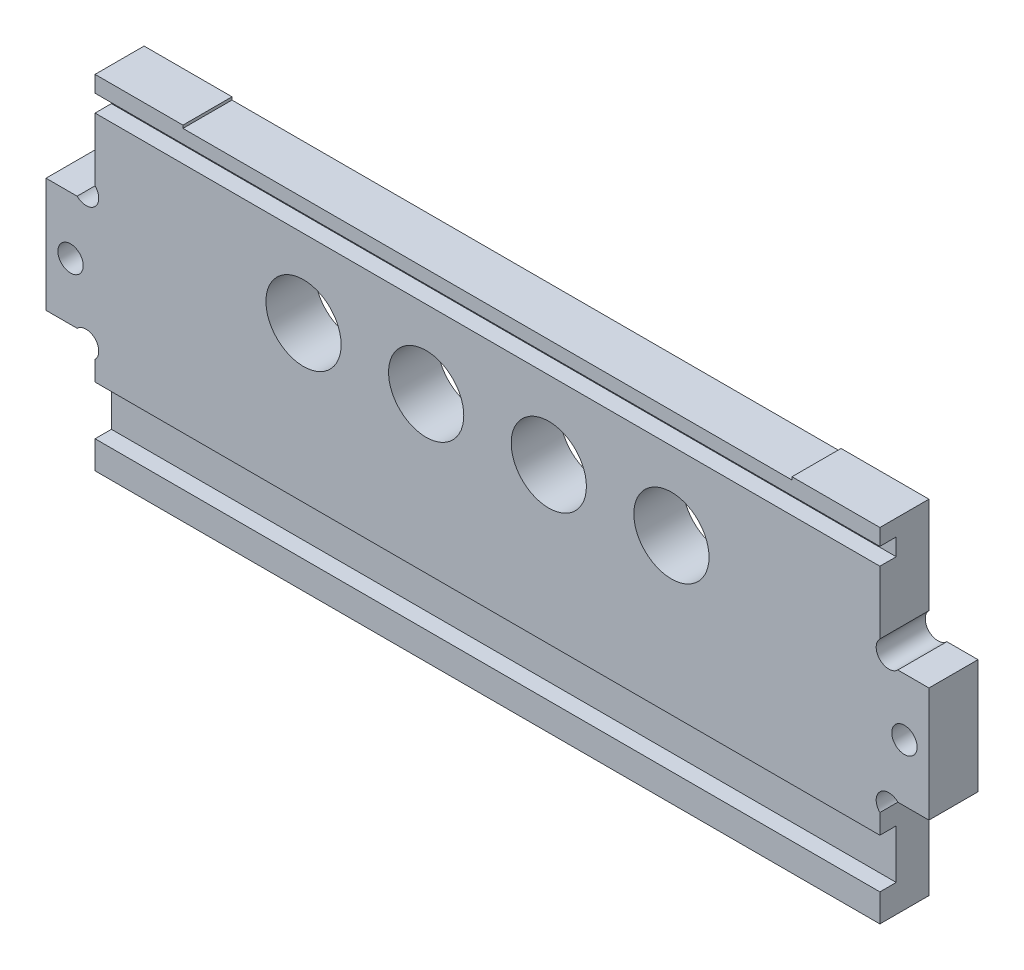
ISO-10303-21;
HEADER;
FILE_DESCRIPTION(('STEP AP214'),'2;1');
FILE_NAME('part.step','',(''),(''),'','','');
FILE_SCHEMA(('AUTOMOTIVE_DESIGN { 1 0 10303 214 1 1 1 1 }'));
ENDSEC;
DATA;
#1=APPLICATION_CONTEXT('core data for automotive mechanical design processes');
#2=APPLICATION_PROTOCOL_DEFINITION('international standard','automotive_design',2000,#1);
#3=PRODUCT_CONTEXT('',#1,'mechanical');
#4=PRODUCT('Part','Part','',(#3));
#5=PRODUCT_RELATED_PRODUCT_CATEGORY('part','',(#4));
#6=PRODUCT_DEFINITION_FORMATION('','',#4);
#7=PRODUCT_DEFINITION_CONTEXT('part definition',#1,'design');
#8=PRODUCT_DEFINITION('design','',#6,#7);
#9=PRODUCT_DEFINITION_SHAPE('','',#8);
#10=(LENGTH_UNIT() NAMED_UNIT(*) SI_UNIT(.MILLI.,.METRE.));
#11=(NAMED_UNIT(*) PLANE_ANGLE_UNIT() SI_UNIT($,.RADIAN.));
#12=(NAMED_UNIT(*) SI_UNIT($,.STERADIAN.) SOLID_ANGLE_UNIT());
#13=UNCERTAINTY_MEASURE_WITH_UNIT(LENGTH_MEASURE(1.E-05),#10,'distance_accuracy_value','');
#14=(GEOMETRIC_REPRESENTATION_CONTEXT(3) GLOBAL_UNCERTAINTY_ASSIGNED_CONTEXT((#13)) GLOBAL_UNIT_ASSIGNED_CONTEXT((#10,
#11,#12)) REPRESENTATION_CONTEXT('',''));
#15=CARTESIAN_POINT('',(0.,0.,0.));
#16=DIRECTION('',(0.,0.,1.));
#17=DIRECTION('',(1.,0.,0.));
#18=AXIS2_PLACEMENT_3D('',#15,#16,#17);
#19=CARTESIAN_POINT('',(4.90398448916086,29.0960155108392,6.));
#20=DIRECTION('',(0.,0.,1.));
#21=DIRECTION('',(1.,0.,0.));
#22=AXIS2_PLACEMENT_3D('',#19,#20,#21);
#23=PLANE('',#22);
#24=DIRECTION('',(-1.,0.,0.));
#25=VECTOR('',#24,1.);
#26=CARTESIAN_POINT('',(3.,9.40000000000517,6.));
#27=LINE('',#26,#25);
#28=CARTESIAN_POINT('',(102.,9.40000000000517,6.));
#29=VERTEX_POINT('',#28);
#30=CARTESIAN_POINT('',(6.,9.40000000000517,6.));
#31=VERTEX_POINT('',#30);
#32=EDGE_CURVE('E232',#29,#31,#27,.T.);
#33=ORIENTED_EDGE('',*,*,#32,.F.);
#34=DIRECTION('',(0.,1.,0.));
#35=VECTOR('',#34,1.);
#36=CARTESIAN_POINT('',(102.,11.8079689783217,6.));
#37=LINE('',#36,#35);
#38=CARTESIAN_POINT('',(102.,11.8079689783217,6.));
#39=VERTEX_POINT('',#38);
#40=EDGE_CURVE('E248',#29,#39,#37,.T.);
#41=ORIENTED_EDGE('',*,*,#40,.T.);
#42=CARTESIAN_POINT('',(103.096015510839,12.9039844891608,6.));
#43=DIRECTION('',(0.,0.,-1.));
#44=DIRECTION('',(1.,0.,0.));
#45=AXIS2_PLACEMENT_3D('',#42,#43,#44);
#46=CIRCLE('',#45,1.55);
#47=CARTESIAN_POINT('',(104.192031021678,14.,6.));
#48=VERTEX_POINT('',#47);
#49=EDGE_CURVE('E250',#39,#48,#46,.T.);
#50=ORIENTED_EDGE('',*,*,#49,.T.);
#51=DIRECTION('',(1.,0.,0.));
#52=VECTOR('',#51,1.);
#53=CARTESIAN_POINT('',(108.,14.,6.));
#54=LINE('',#53,#52);
#55=CARTESIAN_POINT('',(108.,14.,6.));
#56=VERTEX_POINT('',#55);
#57=EDGE_CURVE('E252',#48,#56,#54,.T.);
#58=ORIENTED_EDGE('',*,*,#57,.T.);
#59=DIRECTION('',(0.,1.,0.));
#60=VECTOR('',#59,1.);
#61=CARTESIAN_POINT('',(108.,28.,6.));
#62=LINE('',#61,#60);
#63=CARTESIAN_POINT('',(108.,28.,6.));
#64=VERTEX_POINT('',#63);
#65=EDGE_CURVE('E254',#56,#64,#62,.T.);
#66=ORIENTED_EDGE('',*,*,#65,.T.);
#67=DIRECTION('',(-1.,0.,0.));
#68=VECTOR('',#67,1.);
#69=CARTESIAN_POINT('',(104.192031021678,28.,6.));
#70=LINE('',#69,#68);
#71=CARTESIAN_POINT('',(104.192031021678,28.,6.));
#72=VERTEX_POINT('',#71);
#73=EDGE_CURVE('E256',#64,#72,#70,.T.);
#74=ORIENTED_EDGE('',*,*,#73,.T.);
#75=CARTESIAN_POINT('',(103.096015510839,29.0960155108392,6.));
#76=DIRECTION('',(0.,0.,-1.));
#77=DIRECTION('',(-1.,0.,0.));
#78=AXIS2_PLACEMENT_3D('',#75,#76,#77);
#79=CIRCLE('',#78,1.55);
#80=CARTESIAN_POINT('',(102.,30.1920310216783,6.));
#81=VERTEX_POINT('',#80);
#82=EDGE_CURVE('E258',#72,#81,#79,.T.);
#83=ORIENTED_EDGE('',*,*,#82,.T.);
#84=DIRECTION('',(0.,1.,0.));
#85=VECTOR('',#84,1.);
#86=CARTESIAN_POINT('',(102.,42.,6.));
#87=LINE('',#86,#85);
#88=CARTESIAN_POINT('',(102.,37.89999053,6.));
#89=VERTEX_POINT('',#88);
#90=EDGE_CURVE('E261',#81,#89,#87,.T.);
#91=ORIENTED_EDGE('',*,*,#90,.T.);
#92=DIRECTION('',(1.,0.,0.));
#93=VECTOR('',#92,1.);
#94=CARTESIAN_POINT('',(3.,37.89999053,6.));
#95=LINE('',#94,#93);
#96=CARTESIAN_POINT('',(6.00000000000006,37.89999053,6.));
#97=VERTEX_POINT('',#96);
#98=EDGE_CURVE('E359',#97,#89,#95,.T.);
#99=ORIENTED_EDGE('',*,*,#98,.F.);
#100=DIRECTION('',(0.,-1.,0.));
#101=VECTOR('',#100,1.);
#102=CARTESIAN_POINT('',(6.00000000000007,42.,6.));
#103=LINE('',#102,#101);
#104=CARTESIAN_POINT('',(6.,30.1920310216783,6.));
#105=VERTEX_POINT('',#104);
#106=EDGE_CURVE('E452',#97,#105,#103,.T.);
#107=ORIENTED_EDGE('',*,*,#106,.T.);
#108=CARTESIAN_POINT('',(4.90398448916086,29.0960155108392,6.));
#109=DIRECTION('',(0.,0.,-1.));
#110=DIRECTION('',(1.,0.,0.));
#111=AXIS2_PLACEMENT_3D('',#108,#109,#110);
#112=CIRCLE('',#111,1.55);
#113=CARTESIAN_POINT('',(3.80796897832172,28.,6.));
#114=VERTEX_POINT('',#113);
#115=EDGE_CURVE('E456',#105,#114,#112,.T.);
#116=ORIENTED_EDGE('',*,*,#115,.T.);
#117=DIRECTION('',(-1.,0.,0.));
#118=VECTOR('',#117,1.);
#119=CARTESIAN_POINT('',(3.80796897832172,28.,6.));
#120=LINE('',#119,#118);
#121=CARTESIAN_POINT('',(0.,28.,6.));
#122=VERTEX_POINT('',#121);
#123=EDGE_CURVE('E458',#114,#122,#120,.T.);
#124=ORIENTED_EDGE('',*,*,#123,.T.);
#125=DIRECTION('',(0.,-1.,0.));
#126=VECTOR('',#125,1.);
#127=CARTESIAN_POINT('',(0.,28.,6.));
#128=LINE('',#127,#126);
#129=CARTESIAN_POINT('',(0.,14.,6.));
#130=VERTEX_POINT('',#129);
#131=EDGE_CURVE('E460',#122,#130,#128,.T.);
#132=ORIENTED_EDGE('',*,*,#131,.T.);
#133=DIRECTION('',(1.,0.,0.));
#134=VECTOR('',#133,1.);
#135=CARTESIAN_POINT('',(0.,14.,6.));
#136=LINE('',#135,#134);
#137=CARTESIAN_POINT('',(3.80796897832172,14.,6.));
#138=VERTEX_POINT('',#137);
#139=EDGE_CURVE('E243',#130,#138,#136,.T.);
#140=ORIENTED_EDGE('',*,*,#139,.T.);
#141=CARTESIAN_POINT('',(4.90398448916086,12.9039844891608,6.));
#142=DIRECTION('',(0.,0.,-1.));
#143=DIRECTION('',(-1.,0.,0.));
#144=AXIS2_PLACEMENT_3D('',#141,#142,#143);
#145=CIRCLE('',#144,1.55);
#146=CARTESIAN_POINT('',(6.,11.8079689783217,6.));
#147=VERTEX_POINT('',#146);
#148=EDGE_CURVE('E239',#138,#147,#145,.T.);
#149=ORIENTED_EDGE('',*,*,#148,.T.);
#150=DIRECTION('',(0.,-1.,0.));
#151=VECTOR('',#150,1.);
#152=CARTESIAN_POINT('',(6.,11.8079689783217,6.));
#153=LINE('',#152,#151);
#154=EDGE_CURVE('E238',#147,#31,#153,.T.);
#155=ORIENTED_EDGE('',*,*,#154,.T.);
#156=EDGE_LOOP('',(#33,#41,#50,#58,#66,#74,#83,#91,#99,#107,#116,#124,#132,#140,#149,#155));
#157=FACE_BOUND('',#156,.T.);
#158=CARTESIAN_POINT('',(76.5,28.4,6.));
#159=DIRECTION('',(0.,0.,1.));
#160=DIRECTION('',(1.,0.,0.));
#161=AXIS2_PLACEMENT_3D('',#158,#159,#160);
#162=CIRCLE('',#161,4.60000000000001);
#163=CARTESIAN_POINT('',(81.1,28.4,6.));
#164=VERTEX_POINT('',#163);
#165=EDGE_CURVE('E378',#164,#164,#162,.T.);
#166=ORIENTED_EDGE('',*,*,#165,.F.);
#167=EDGE_LOOP('',(#166));
#168=FACE_BOUND('',#167,.T.);
#169=CARTESIAN_POINT('',(46.5,28.4,6.));
#170=DIRECTION('',(0.,0.,1.));
#171=DIRECTION('',(1.,0.,0.));
#172=AXIS2_PLACEMENT_3D('',#169,#170,#171);
#173=CIRCLE('',#172,4.6);
#174=CARTESIAN_POINT('',(51.1,28.4,6.));
#175=VERTEX_POINT('',#174);
#176=EDGE_CURVE('E390',#175,#175,#173,.T.);
#177=ORIENTED_EDGE('',*,*,#176,.F.);
#178=EDGE_LOOP('',(#177));
#179=FACE_BOUND('',#178,.T.);
#180=CARTESIAN_POINT('',(3.,21.,6.));
#181=DIRECTION('',(0.,0.,1.));
#182=DIRECTION('',(1.,0.,0.));
#183=AXIS2_PLACEMENT_3D('',#180,#181,#182);
#184=CIRCLE('',#183,1.55);
#185=CARTESIAN_POINT('',(4.55,21.,6.));
#186=VERTEX_POINT('',#185);
#187=EDGE_CURVE('E402',#186,#186,#184,.T.);
#188=ORIENTED_EDGE('',*,*,#187,.F.);
#189=EDGE_LOOP('',(#188));
#190=FACE_BOUND('',#189,.T.);
#191=CARTESIAN_POINT('',(31.5,28.4,6.));
#192=DIRECTION('',(0.,0.,1.));
#193=DIRECTION('',(1.,0.,0.));
#194=AXIS2_PLACEMENT_3D('',#191,#192,#193);
#195=CIRCLE('',#194,4.6);
#196=CARTESIAN_POINT('',(36.1,28.4,6.));
#197=VERTEX_POINT('',#196);
#198=EDGE_CURVE('E408',#197,#197,#195,.T.);
#199=ORIENTED_EDGE('',*,*,#198,.F.);
#200=EDGE_LOOP('',(#199));
#201=FACE_BOUND('',#200,.T.);
#202=CARTESIAN_POINT('',(105.,21.,6.));
#203=DIRECTION('',(0.,0.,1.));
#204=DIRECTION('',(-1.,0.,0.));
#205=AXIS2_PLACEMENT_3D('',#202,#203,#204);
#206=CIRCLE('',#205,1.55000000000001);
#207=CARTESIAN_POINT('',(103.45,21.,6.));
#208=VERTEX_POINT('',#207);
#209=EDGE_CURVE('E396',#208,#208,#206,.T.);
#210=ORIENTED_EDGE('',*,*,#209,.F.);
#211=EDGE_LOOP('',(#210));
#212=FACE_BOUND('',#211,.T.);
#213=CARTESIAN_POINT('',(61.5,28.4,6.));
#214=DIRECTION('',(0.,0.,1.));
#215=DIRECTION('',(1.,0.,0.));
#216=AXIS2_PLACEMENT_3D('',#213,#214,#215);
#217=CIRCLE('',#216,4.60000000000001);
#218=CARTESIAN_POINT('',(66.1,28.4,6.));
#219=VERTEX_POINT('',#218);
#220=EDGE_CURVE('E384',#219,#219,#217,.T.);
#221=ORIENTED_EDGE('',*,*,#220,.F.);
#222=EDGE_LOOP('',(#221));
#223=FACE_BOUND('',#222,.T.);
#224=ADVANCED_FACE('F30',(#157,#168,#179,#190,#201,#212,#223),#23,.T.);
#225=DIRECTION('',(-1.,0.,0.));
#226=VECTOR('',#225,1.);
#227=CARTESIAN_POINT('',(3.,40.,6.));
#228=LINE('',#227,#226);
#229=CARTESIAN_POINT('',(102.,40.,6.));
#230=VERTEX_POINT('',#229);
#231=CARTESIAN_POINT('',(6.00000000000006,40.,6.));
#232=VERTEX_POINT('',#231);
#233=EDGE_CURVE('E361',#230,#232,#228,.T.);
#234=ORIENTED_EDGE('',*,*,#233,.F.);
#235=CARTESIAN_POINT('',(102.,42.,6.));
#236=VERTEX_POINT('',#235);
#237=EDGE_CURVE('E260',#230,#236,#87,.T.);
#238=ORIENTED_EDGE('',*,*,#237,.T.);
#239=DIRECTION('',(-1.,0.,0.));
#240=VECTOR('',#239,1.);
#241=CARTESIAN_POINT('',(91.25,42.,6.));
#242=LINE('',#241,#240);
#243=CARTESIAN_POINT('',(91.25,42.,6.));
#244=VERTEX_POINT('',#243);
#245=EDGE_CURVE('E264',#236,#244,#242,.T.);
#246=ORIENTED_EDGE('',*,*,#245,.T.);
#247=DIRECTION('',(0.,-1.,0.));
#248=VECTOR('',#247,1.);
#249=CARTESIAN_POINT('',(91.25,41.65,6.));
#250=LINE('',#249,#248);
#251=CARTESIAN_POINT('',(91.25,41.65,6.));
#252=VERTEX_POINT('',#251);
#253=EDGE_CURVE('E266',#244,#252,#250,.T.);
#254=ORIENTED_EDGE('',*,*,#253,.T.);
#255=DIRECTION('',(-1.,0.,0.));
#256=VECTOR('',#255,1.);
#257=CARTESIAN_POINT('',(91.25,41.65,6.));
#258=LINE('',#257,#256);
#259=CARTESIAN_POINT('',(16.75,41.65,6.));
#260=VERTEX_POINT('',#259);
#261=EDGE_CURVE('E268',#252,#260,#258,.T.);
#262=ORIENTED_EDGE('',*,*,#261,.T.);
#263=DIRECTION('',(0.,1.,0.));
#264=VECTOR('',#263,1.);
#265=CARTESIAN_POINT('',(16.75,42.,6.));
#266=LINE('',#265,#264);
#267=CARTESIAN_POINT('',(16.75,42.,6.));
#268=VERTEX_POINT('',#267);
#269=EDGE_CURVE('E270',#260,#268,#266,.T.);
#270=ORIENTED_EDGE('',*,*,#269,.T.);
#271=DIRECTION('',(-1.,0.,0.));
#272=VECTOR('',#271,1.);
#273=CARTESIAN_POINT('',(6.00000000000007,42.,6.));
#274=LINE('',#273,#272);
#275=CARTESIAN_POINT('',(6.00000000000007,42.,6.));
#276=VERTEX_POINT('',#275);
#277=EDGE_CURVE('E272',#268,#276,#274,.T.);
#278=ORIENTED_EDGE('',*,*,#277,.T.);
#279=EDGE_CURVE('E453',#276,#232,#103,.T.);
#280=ORIENTED_EDGE('',*,*,#279,.T.);
#281=EDGE_LOOP('',(#234,#238,#246,#254,#262,#270,#278,#280));
#282=FACE_BOUND('',#281,.T.);
#283=ADVANCED_FACE('F547',(#282),#23,.T.);
#284=DIRECTION('',(1.,0.,0.));
#285=VECTOR('',#284,1.);
#286=CARTESIAN_POINT('',(3.,3.40000000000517,6.));
#287=LINE('',#286,#285);
#288=CARTESIAN_POINT('',(6.,3.40000000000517,6.));
#289=VERTEX_POINT('',#288);
#290=CARTESIAN_POINT('',(102.,3.40000000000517,6.));
#291=VERTEX_POINT('',#290);
#292=EDGE_CURVE('E217',#289,#291,#287,.T.);
#293=ORIENTED_EDGE('',*,*,#292,.F.);
#294=CARTESIAN_POINT('',(6.,0.,6.));
#295=VERTEX_POINT('',#294);
#296=EDGE_CURVE('E228',#289,#295,#153,.T.);
#297=ORIENTED_EDGE('',*,*,#296,.T.);
#298=DIRECTION('',(1.,0.,0.));
#299=VECTOR('',#298,1.);
#300=CARTESIAN_POINT('',(6.,0.,6.));
#301=LINE('',#300,#299);
#302=CARTESIAN_POINT('',(102.,0.,6.));
#303=VERTEX_POINT('',#302);
#304=EDGE_CURVE('E242',#295,#303,#301,.T.);
#305=ORIENTED_EDGE('',*,*,#304,.T.);
#306=EDGE_CURVE('E231',#303,#291,#37,.T.);
#307=ORIENTED_EDGE('',*,*,#306,.T.);
#308=EDGE_LOOP('',(#293,#297,#305,#307));
#309=FACE_BOUND('',#308,.T.);
#310=ADVANCED_FACE('F227',(#309),#23,.T.);
#311=CARTESIAN_POINT('',(4.90398448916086,29.0960155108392,0.));
#312=DIRECTION('',(0.,0.,1.));
#313=DIRECTION('',(1.,0.,0.));
#314=AXIS2_PLACEMENT_3D('',#311,#312,#313);
#315=PLANE('',#314);
#316=CARTESIAN_POINT('',(61.5,28.4,0.));
#317=DIRECTION('',(0.,0.,1.));
#318=DIRECTION('',(1.,0.,0.));
#319=AXIS2_PLACEMENT_3D('',#316,#317,#318);
#320=CIRCLE('',#319,4.60000000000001);
#321=CARTESIAN_POINT('',(66.1,28.4,0.));
#322=VERTEX_POINT('',#321);
#323=EDGE_CURVE('E381',#322,#322,#320,.T.);
#324=ORIENTED_EDGE('',*,*,#323,.T.);
#325=EDGE_LOOP('',(#324));
#326=FACE_BOUND('',#325,.T.);
#327=CARTESIAN_POINT('',(105.,21.,0.));
#328=DIRECTION('',(0.,0.,1.));
#329=DIRECTION('',(-1.,0.,0.));
#330=AXIS2_PLACEMENT_3D('',#327,#328,#329);
#331=CIRCLE('',#330,1.55000000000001);
#332=CARTESIAN_POINT('',(103.45,21.,0.));
#333=VERTEX_POINT('',#332);
#334=EDGE_CURVE('E393',#333,#333,#331,.T.);
#335=ORIENTED_EDGE('',*,*,#334,.T.);
#336=EDGE_LOOP('',(#335));
#337=FACE_BOUND('',#336,.T.);
#338=CARTESIAN_POINT('',(31.5,28.4,0.));
#339=DIRECTION('',(0.,0.,1.));
#340=DIRECTION('',(1.,0.,0.));
#341=AXIS2_PLACEMENT_3D('',#338,#339,#340);
#342=CIRCLE('',#341,4.6);
#343=CARTESIAN_POINT('',(36.1,28.4,0.));
#344=VERTEX_POINT('',#343);
#345=EDGE_CURVE('E405',#344,#344,#342,.T.);
#346=ORIENTED_EDGE('',*,*,#345,.T.);
#347=EDGE_LOOP('',(#346));
#348=FACE_BOUND('',#347,.T.);
#349=DIRECTION('',(0.,-1.,0.));
#350=VECTOR('',#349,1.);
#351=CARTESIAN_POINT('',(6.00000000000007,42.,0.));
#352=LINE('',#351,#350);
#353=CARTESIAN_POINT('',(6.00000000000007,42.,0.));
#354=VERTEX_POINT('',#353);
#355=CARTESIAN_POINT('',(6.,30.1920310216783,0.));
#356=VERTEX_POINT('',#355);
#357=EDGE_CURVE('E411',#354,#356,#352,.T.);
#358=ORIENTED_EDGE('',*,*,#357,.F.);
#359=DIRECTION('',(-1.,0.,0.));
#360=VECTOR('',#359,1.);
#361=CARTESIAN_POINT('',(6.00000000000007,42.,0.));
#362=LINE('',#361,#360);
#363=CARTESIAN_POINT('',(16.75,42.,0.));
#364=VERTEX_POINT('',#363);
#365=EDGE_CURVE('E450',#364,#354,#362,.T.);
#366=ORIENTED_EDGE('',*,*,#365,.F.);
#367=DIRECTION('',(0.,1.,0.));
#368=VECTOR('',#367,1.);
#369=CARTESIAN_POINT('',(16.75,42.,0.));
#370=LINE('',#369,#368);
#371=CARTESIAN_POINT('',(16.75,41.65,0.));
#372=VERTEX_POINT('',#371);
#373=EDGE_CURVE('E448',#372,#364,#370,.T.);
#374=ORIENTED_EDGE('',*,*,#373,.F.);
#375=DIRECTION('',(-1.,0.,0.));
#376=VECTOR('',#375,1.);
#377=CARTESIAN_POINT('',(91.25,41.65,0.));
#378=LINE('',#377,#376);
#379=CARTESIAN_POINT('',(91.25,41.65,0.));
#380=VERTEX_POINT('',#379);
#381=EDGE_CURVE('E446',#380,#372,#378,.T.);
#382=ORIENTED_EDGE('',*,*,#381,.F.);
#383=DIRECTION('',(0.,-1.,0.));
#384=VECTOR('',#383,1.);
#385=CARTESIAN_POINT('',(91.25,41.65,0.));
#386=LINE('',#385,#384);
#387=CARTESIAN_POINT('',(91.25,42.,0.));
#388=VERTEX_POINT('',#387);
#389=EDGE_CURVE('E444',#388,#380,#386,.T.);
#390=ORIENTED_EDGE('',*,*,#389,.F.);
#391=DIRECTION('',(-1.,0.,0.));
#392=VECTOR('',#391,1.);
#393=CARTESIAN_POINT('',(91.25,42.,0.));
#394=LINE('',#393,#392);
#395=CARTESIAN_POINT('',(102.,42.,0.));
#396=VERTEX_POINT('',#395);
#397=EDGE_CURVE('E442',#396,#388,#394,.T.);
#398=ORIENTED_EDGE('',*,*,#397,.F.);
#399=DIRECTION('',(0.,1.,0.));
#400=VECTOR('',#399,1.);
#401=CARTESIAN_POINT('',(102.,42.,0.));
#402=LINE('',#401,#400);
#403=CARTESIAN_POINT('',(102.,30.1920310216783,0.));
#404=VERTEX_POINT('',#403);
#405=EDGE_CURVE('E440',#404,#396,#402,.T.);
#406=ORIENTED_EDGE('',*,*,#405,.F.);
#407=CARTESIAN_POINT('',(103.096015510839,29.0960155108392,0.));
#408=DIRECTION('',(0.,0.,-1.));
#409=DIRECTION('',(-1.,0.,0.));
#410=AXIS2_PLACEMENT_3D('',#407,#408,#409);
#411=CIRCLE('',#410,1.55);
#412=CARTESIAN_POINT('',(104.192031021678,28.,0.));
#413=VERTEX_POINT('',#412);
#414=EDGE_CURVE('E438',#413,#404,#411,.T.);
#415=ORIENTED_EDGE('',*,*,#414,.F.);
#416=DIRECTION('',(-1.,0.,0.));
#417=VECTOR('',#416,1.);
#418=CARTESIAN_POINT('',(104.192031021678,28.,0.));
#419=LINE('',#418,#417);
#420=CARTESIAN_POINT('',(108.,28.,0.));
#421=VERTEX_POINT('',#420);
#422=EDGE_CURVE('E436',#421,#413,#419,.T.);
#423=ORIENTED_EDGE('',*,*,#422,.F.);
#424=DIRECTION('',(0.,1.,0.));
#425=VECTOR('',#424,1.);
#426=CARTESIAN_POINT('',(108.,28.,0.));
#427=LINE('',#426,#425);
#428=CARTESIAN_POINT('',(108.,14.,0.));
#429=VERTEX_POINT('',#428);
#430=EDGE_CURVE('E434',#429,#421,#427,.T.);
#431=ORIENTED_EDGE('',*,*,#430,.F.);
#432=DIRECTION('',(1.,0.,0.));
#433=VECTOR('',#432,1.);
#434=CARTESIAN_POINT('',(108.,14.,0.));
#435=LINE('',#434,#433);
#436=CARTESIAN_POINT('',(104.192031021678,14.,0.));
#437=VERTEX_POINT('',#436);
#438=EDGE_CURVE('E432',#437,#429,#435,.T.);
#439=ORIENTED_EDGE('',*,*,#438,.F.);
#440=CARTESIAN_POINT('',(103.096015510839,12.9039844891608,0.));
#441=DIRECTION('',(0.,0.,-1.));
#442=DIRECTION('',(1.,0.,0.));
#443=AXIS2_PLACEMENT_3D('',#440,#441,#442);
#444=CIRCLE('',#443,1.55);
#445=CARTESIAN_POINT('',(102.,11.8079689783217,0.));
#446=VERTEX_POINT('',#445);
#447=EDGE_CURVE('E430',#446,#437,#444,.T.);
#448=ORIENTED_EDGE('',*,*,#447,.F.);
#449=DIRECTION('',(0.,1.,0.));
#450=VECTOR('',#449,1.);
#451=CARTESIAN_POINT('',(102.,11.8079689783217,0.));
#452=LINE('',#451,#450);
#453=CARTESIAN_POINT('',(102.,0.,0.));
#454=VERTEX_POINT('',#453);
#455=EDGE_CURVE('E428',#454,#446,#452,.T.);
#456=ORIENTED_EDGE('',*,*,#455,.F.);
#457=DIRECTION('',(1.,0.,0.));
#458=VECTOR('',#457,1.);
#459=CARTESIAN_POINT('',(6.,0.,0.));
#460=LINE('',#459,#458);
#461=CARTESIAN_POINT('',(6.,0.,0.));
#462=VERTEX_POINT('',#461);
#463=EDGE_CURVE('E426',#462,#454,#460,.T.);
#464=ORIENTED_EDGE('',*,*,#463,.F.);
#465=DIRECTION('',(0.,-1.,0.));
#466=VECTOR('',#465,1.);
#467=CARTESIAN_POINT('',(6.,11.8079689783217,0.));
#468=LINE('',#467,#466);
#469=CARTESIAN_POINT('',(6.,11.8079689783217,0.));
#470=VERTEX_POINT('',#469);
#471=EDGE_CURVE('E424',#470,#462,#468,.T.);
#472=ORIENTED_EDGE('',*,*,#471,.F.);
#473=CARTESIAN_POINT('',(4.90398448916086,12.9039844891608,0.));
#474=DIRECTION('',(0.,0.,-1.));
#475=DIRECTION('',(-1.,0.,0.));
#476=AXIS2_PLACEMENT_3D('',#473,#474,#475);
#477=CIRCLE('',#476,1.55);
#478=CARTESIAN_POINT('',(3.80796897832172,14.,0.));
#479=VERTEX_POINT('',#478);
#480=EDGE_CURVE('E422',#479,#470,#477,.T.);
#481=ORIENTED_EDGE('',*,*,#480,.F.);
#482=DIRECTION('',(1.,0.,0.));
#483=VECTOR('',#482,1.);
#484=CARTESIAN_POINT('',(0.,14.,0.));
#485=LINE('',#484,#483);
#486=CARTESIAN_POINT('',(0.,14.,0.));
#487=VERTEX_POINT('',#486);
#488=EDGE_CURVE('E420',#487,#479,#485,.T.);
#489=ORIENTED_EDGE('',*,*,#488,.F.);
#490=DIRECTION('',(0.,-1.,0.));
#491=VECTOR('',#490,1.);
#492=CARTESIAN_POINT('',(0.,28.,0.));
#493=LINE('',#492,#491);
#494=CARTESIAN_POINT('',(0.,28.,0.));
#495=VERTEX_POINT('',#494);
#496=EDGE_CURVE('E418',#495,#487,#493,.T.);
#497=ORIENTED_EDGE('',*,*,#496,.F.);
#498=DIRECTION('',(-1.,0.,0.));
#499=VECTOR('',#498,1.);
#500=CARTESIAN_POINT('',(3.80796897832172,28.,0.));
#501=LINE('',#500,#499);
#502=CARTESIAN_POINT('',(3.80796897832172,28.,0.));
#503=VERTEX_POINT('',#502);
#504=EDGE_CURVE('E416',#503,#495,#501,.T.);
#505=ORIENTED_EDGE('',*,*,#504,.F.);
#506=CARTESIAN_POINT('',(4.90398448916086,29.0960155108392,0.));
#507=DIRECTION('',(0.,0.,-1.));
#508=DIRECTION('',(1.,0.,0.));
#509=AXIS2_PLACEMENT_3D('',#506,#507,#508);
#510=CIRCLE('',#509,1.55);
#511=EDGE_CURVE('E414',#356,#503,#510,.T.);
#512=ORIENTED_EDGE('',*,*,#511,.F.);
#513=EDGE_LOOP('',(#358,#366,#374,#382,#390,#398,#406,#415,#423,#431,#439,#448,#456,#464,#472,
#481,#489,#497,#505,#512));
#514=FACE_BOUND('',#513,.T.);
#515=CARTESIAN_POINT('',(3.,21.,0.));
#516=DIRECTION('',(0.,0.,1.));
#517=DIRECTION('',(1.,0.,0.));
#518=AXIS2_PLACEMENT_3D('',#515,#516,#517);
#519=CIRCLE('',#518,1.55);
#520=CARTESIAN_POINT('',(4.55,21.,0.));
#521=VERTEX_POINT('',#520);
#522=EDGE_CURVE('E399',#521,#521,#519,.T.);
#523=ORIENTED_EDGE('',*,*,#522,.T.);
#524=EDGE_LOOP('',(#523));
#525=FACE_BOUND('',#524,.T.);
#526=CARTESIAN_POINT('',(46.5,28.4,0.));
#527=DIRECTION('',(0.,0.,1.));
#528=DIRECTION('',(1.,0.,0.));
#529=AXIS2_PLACEMENT_3D('',#526,#527,#528);
#530=CIRCLE('',#529,4.6);
#531=CARTESIAN_POINT('',(51.1,28.4,0.));
#532=VERTEX_POINT('',#531);
#533=EDGE_CURVE('E387',#532,#532,#530,.T.);
#534=ORIENTED_EDGE('',*,*,#533,.T.);
#535=EDGE_LOOP('',(#534));
#536=FACE_BOUND('',#535,.T.);
#537=CARTESIAN_POINT('',(76.5,28.4,0.));
#538=DIRECTION('',(0.,0.,1.));
#539=DIRECTION('',(1.,0.,0.));
#540=AXIS2_PLACEMENT_3D('',#537,#538,#539);
#541=CIRCLE('',#540,4.60000000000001);
#542=CARTESIAN_POINT('',(81.1,28.4,0.));
#543=VERTEX_POINT('',#542);
#544=EDGE_CURVE('E375',#543,#543,#541,.T.);
#545=ORIENTED_EDGE('',*,*,#544,.T.);
#546=EDGE_LOOP('',(#545));
#547=FACE_BOUND('',#546,.T.);
#548=ADVANCED_FACE('F531',(#326,#337,#348,#514,#525,#536,#547),#315,.F.);
#549=CARTESIAN_POINT('',(6.00000000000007,42.,6.));
#550=DIRECTION('',(1.,0.,0.));
#551=DIRECTION('',(0.,1.,0.));
#552=AXIS2_PLACEMENT_3D('',#549,#550,#551);
#553=PLANE('',#552);
#554=DIRECTION('',(0.,-1.,0.));
#555=VECTOR('',#554,1.);
#556=CARTESIAN_POINT('',(6.00000000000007,42.,4.));
#557=LINE('',#556,#555);
#558=CARTESIAN_POINT('',(6.00000000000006,40.,4.));
#559=VERTEX_POINT('',#558);
#560=CARTESIAN_POINT('',(6.00000000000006,37.89999053,4.));
#561=VERTEX_POINT('',#560);
#562=EDGE_CURVE('E367',#559,#561,#557,.T.);
#563=ORIENTED_EDGE('',*,*,#562,.F.);
#564=DIRECTION('',(0.,0.,1.));
#565=VECTOR('',#564,1.);
#566=CARTESIAN_POINT('',(6.00000000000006,40.,6.));
#567=LINE('',#566,#565);
#568=EDGE_CURVE('E372',#559,#232,#567,.T.);
#569=ORIENTED_EDGE('',*,*,#568,.T.);
#570=ORIENTED_EDGE('',*,*,#279,.F.);
#571=DIRECTION('',(0.,0.,-1.));
#572=VECTOR('',#571,1.);
#573=CARTESIAN_POINT('',(6.00000000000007,42.,6.));
#574=LINE('',#573,#572);
#575=EDGE_CURVE('E274',#276,#354,#574,.T.);
#576=ORIENTED_EDGE('',*,*,#575,.T.);
#577=ORIENTED_EDGE('',*,*,#357,.T.);
#578=DIRECTION('',(0.,0.,-1.));
#579=VECTOR('',#578,1.);
#580=CARTESIAN_POINT('',(6.,30.1920310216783,6.));
#581=LINE('',#580,#579);
#582=EDGE_CURVE('E329',#105,#356,#581,.T.);
#583=ORIENTED_EDGE('',*,*,#582,.F.);
#584=ORIENTED_EDGE('',*,*,#106,.F.);
#585=DIRECTION('',(0.,0.,-1.));
#586=VECTOR('',#585,1.);
#587=CARTESIAN_POINT('',(6.00000000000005,37.89999053,6.));
#588=LINE('',#587,#586);
#589=EDGE_CURVE('E369',#97,#561,#588,.T.);
#590=ORIENTED_EDGE('',*,*,#589,.T.);
#591=EDGE_LOOP('',(#563,#569,#570,#576,#577,#583,#584,#590));
#592=FACE_BOUND('',#591,.T.);
#593=ADVANCED_FACE('F32',(#592),#553,.F.);
#594=CARTESIAN_POINT('',(4.90398448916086,29.0960155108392,6.));
#595=DIRECTION('',(0.,0.,-1.));
#596=DIRECTION('',(-1.,0.,0.));
#597=AXIS2_PLACEMENT_3D('',#594,#595,#596);
#598=CYLINDRICAL_SURFACE('',#597,1.55);
#599=ORIENTED_EDGE('',*,*,#511,.T.);
#600=DIRECTION('',(0.,0.,-1.));
#601=VECTOR('',#600,1.);
#602=CARTESIAN_POINT('',(3.80796897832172,28.,6.));
#603=LINE('',#602,#601);
#604=EDGE_CURVE('E326',#114,#503,#603,.T.);
#605=ORIENTED_EDGE('',*,*,#604,.F.);
#606=ORIENTED_EDGE('',*,*,#115,.F.);
#607=ORIENTED_EDGE('',*,*,#582,.T.);
#608=EDGE_LOOP('',(#599,#605,#606,#607));
#609=FACE_BOUND('',#608,.T.);
#610=ADVANCED_FACE('F520',(#609),#598,.F.);
#611=CARTESIAN_POINT('',(3.80796897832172,28.,6.));
#612=DIRECTION('',(0.,-1.,0.));
#613=DIRECTION('',(0.,0.,-1.));
#614=AXIS2_PLACEMENT_3D('',#611,#612,#613);
#615=PLANE('',#614);
#616=ORIENTED_EDGE('',*,*,#504,.T.);
#617=DIRECTION('',(0.,0.,-1.));
#618=VECTOR('',#617,1.);
#619=CARTESIAN_POINT('',(0.,28.,6.));
#620=LINE('',#619,#618);
#621=EDGE_CURVE('E323',#122,#495,#620,.T.);
#622=ORIENTED_EDGE('',*,*,#621,.F.);
#623=ORIENTED_EDGE('',*,*,#123,.F.);
#624=ORIENTED_EDGE('',*,*,#604,.T.);
#625=EDGE_LOOP('',(#616,#622,#623,#624));
#626=FACE_BOUND('',#625,.T.);
#627=ADVANCED_FACE('F525',(#626),#615,.F.);
#628=CARTESIAN_POINT('',(0.,28.,6.));
#629=DIRECTION('',(1.,0.,0.));
#630=DIRECTION('',(0.,0.,-1.));
#631=AXIS2_PLACEMENT_3D('',#628,#629,#630);
#632=PLANE('',#631);
#633=ORIENTED_EDGE('',*,*,#496,.T.);
#634=DIRECTION('',(0.,0.,-1.));
#635=VECTOR('',#634,1.);
#636=CARTESIAN_POINT('',(0.,14.,6.));
#637=LINE('',#636,#635);
#638=EDGE_CURVE('E320',#130,#487,#637,.T.);
#639=ORIENTED_EDGE('',*,*,#638,.F.);
#640=ORIENTED_EDGE('',*,*,#131,.F.);
#641=ORIENTED_EDGE('',*,*,#621,.T.);
#642=EDGE_LOOP('',(#633,#639,#640,#641));
#643=FACE_BOUND('',#642,.T.);
#644=ADVANCED_FACE('F529',(#643),#632,.F.);
#645=CARTESIAN_POINT('',(0.,14.,6.));
#646=DIRECTION('',(0.,1.,0.));
#647=DIRECTION('',(0.,0.,1.));
#648=AXIS2_PLACEMENT_3D('',#645,#646,#647);
#649=PLANE('',#648);
#650=ORIENTED_EDGE('',*,*,#488,.T.);
#651=DIRECTION('',(0.,0.,-1.));
#652=VECTOR('',#651,1.);
#653=CARTESIAN_POINT('',(3.80796897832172,14.,6.));
#654=LINE('',#653,#652);
#655=EDGE_CURVE('E317',#138,#479,#654,.T.);
#656=ORIENTED_EDGE('',*,*,#655,.F.);
#657=ORIENTED_EDGE('',*,*,#139,.F.);
#658=ORIENTED_EDGE('',*,*,#638,.T.);
#659=EDGE_LOOP('',(#650,#656,#657,#658));
#660=FACE_BOUND('',#659,.T.);
#661=ADVANCED_FACE('F470',(#660),#649,.F.);
#662=CARTESIAN_POINT('',(4.90398448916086,12.9039844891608,6.));
#663=DIRECTION('',(0.,0.,-1.));
#664=DIRECTION('',(-1.,0.,0.));
#665=AXIS2_PLACEMENT_3D('',#662,#663,#664);
#666=CYLINDRICAL_SURFACE('',#665,1.55);
#667=ORIENTED_EDGE('',*,*,#480,.T.);
#668=DIRECTION('',(0.,0.,-1.));
#669=VECTOR('',#668,1.);
#670=CARTESIAN_POINT('',(6.,11.8079689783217,6.));
#671=LINE('',#670,#669);
#672=EDGE_CURVE('E314',#147,#470,#671,.T.);
#673=ORIENTED_EDGE('',*,*,#672,.F.);
#674=ORIENTED_EDGE('',*,*,#148,.F.);
#675=ORIENTED_EDGE('',*,*,#655,.T.);
#676=EDGE_LOOP('',(#667,#673,#674,#675));
#677=FACE_BOUND('',#676,.T.);
#678=ADVANCED_FACE('F474',(#677),#666,.F.);
#679=CARTESIAN_POINT('',(6.,11.8079689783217,6.));
#680=DIRECTION('',(1.,0.,0.));
#681=DIRECTION('',(0.,1.,0.));
#682=AXIS2_PLACEMENT_3D('',#679,#680,#681);
#683=PLANE('',#682);
#684=DIRECTION('',(0.,-1.,0.));
#685=VECTOR('',#684,1.);
#686=CARTESIAN_POINT('',(6.,11.8079689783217,4.));
#687=LINE('',#686,#685);
#688=CARTESIAN_POINT('',(6.,9.40000000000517,4.));
#689=VERTEX_POINT('',#688);
#690=CARTESIAN_POINT('',(6.,3.40000000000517,4.));
#691=VERTEX_POINT('',#690);
#692=EDGE_CURVE('E223',#689,#691,#687,.T.);
#693=ORIENTED_EDGE('',*,*,#692,.F.);
#694=DIRECTION('',(0.,0.,1.));
#695=VECTOR('',#694,1.);
#696=CARTESIAN_POINT('',(6.,9.40000000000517,6.));
#697=LINE('',#696,#695);
#698=EDGE_CURVE('E222',#689,#31,#697,.T.);
#699=ORIENTED_EDGE('',*,*,#698,.T.);
#700=ORIENTED_EDGE('',*,*,#154,.F.);
#701=ORIENTED_EDGE('',*,*,#672,.T.);
#702=ORIENTED_EDGE('',*,*,#471,.T.);
#703=DIRECTION('',(0.,0.,-1.));
#704=VECTOR('',#703,1.);
#705=CARTESIAN_POINT('',(6.,0.,6.));
#706=LINE('',#705,#704);
#707=EDGE_CURVE('E236',#295,#462,#706,.T.);
#708=ORIENTED_EDGE('',*,*,#707,.F.);
#709=ORIENTED_EDGE('',*,*,#296,.F.);
#710=DIRECTION('',(0.,0.,-1.));
#711=VECTOR('',#710,1.);
#712=CARTESIAN_POINT('',(6.,3.40000000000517,6.));
#713=LINE('',#712,#711);
#714=EDGE_CURVE('E214',#289,#691,#713,.T.);
#715=ORIENTED_EDGE('',*,*,#714,.T.);
#716=EDGE_LOOP('',(#693,#699,#700,#701,#702,#708,#709,#715));
#717=FACE_BOUND('',#716,.T.);
#718=ADVANCED_FACE('F234',(#717),#683,.F.);
#719=CARTESIAN_POINT('',(6.,0.,6.));
#720=DIRECTION('',(0.,1.,0.));
#721=DIRECTION('',(-1.,0.,0.));
#722=AXIS2_PLACEMENT_3D('',#719,#720,#721);
#723=PLANE('',#722);
#724=ORIENTED_EDGE('',*,*,#463,.T.);
#725=DIRECTION('',(0.,0.,-1.));
#726=VECTOR('',#725,1.);
#727=CARTESIAN_POINT('',(102.,0.,6.));
#728=LINE('',#727,#726);
#729=EDGE_CURVE('E310',#303,#454,#728,.T.);
#730=ORIENTED_EDGE('',*,*,#729,.F.);
#731=ORIENTED_EDGE('',*,*,#304,.F.);
#732=ORIENTED_EDGE('',*,*,#707,.T.);
#733=EDGE_LOOP('',(#724,#730,#731,#732));
#734=FACE_BOUND('',#733,.T.);
#735=ADVANCED_FACE('F535',(#734),#723,.F.);
#736=CARTESIAN_POINT('',(102.,11.8079689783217,6.));
#737=DIRECTION('',(-1.,0.,0.));
#738=DIRECTION('',(0.,-1.,0.));
#739=AXIS2_PLACEMENT_3D('',#736,#737,#738);
#740=PLANE('',#739);
#741=ORIENTED_EDGE('',*,*,#40,.F.);
#742=DIRECTION('',(0.,0.,-1.));
#743=VECTOR('',#742,1.);
#744=CARTESIAN_POINT('',(102.,9.40000000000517,6.));
#745=LINE('',#744,#743);
#746=CARTESIAN_POINT('',(102.,9.40000000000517,4.));
#747=VERTEX_POINT('',#746);
#748=EDGE_CURVE('E11',#29,#747,#745,.T.);
#749=ORIENTED_EDGE('',*,*,#748,.T.);
#750=DIRECTION('',(0.,1.,0.));
#751=VECTOR('',#750,1.);
#752=CARTESIAN_POINT('',(102.,11.8079689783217,4.));
#753=LINE('',#752,#751);
#754=CARTESIAN_POINT('',(102.,3.40000000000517,4.));
#755=VERTEX_POINT('',#754);
#756=EDGE_CURVE('E340',#755,#747,#753,.T.);
#757=ORIENTED_EDGE('',*,*,#756,.F.);
#758=DIRECTION('',(0.,0.,1.));
#759=VECTOR('',#758,1.);
#760=CARTESIAN_POINT('',(102.,3.40000000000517,6.));
#761=LINE('',#760,#759);
#762=EDGE_CURVE('E38',#755,#291,#761,.T.);
#763=ORIENTED_EDGE('',*,*,#762,.T.);
#764=ORIENTED_EDGE('',*,*,#306,.F.);
#765=ORIENTED_EDGE('',*,*,#729,.T.);
#766=ORIENTED_EDGE('',*,*,#455,.T.);
#767=DIRECTION('',(0.,0.,-1.));
#768=VECTOR('',#767,1.);
#769=CARTESIAN_POINT('',(102.,11.8079689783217,6.));
#770=LINE('',#769,#768);
#771=EDGE_CURVE('E307',#39,#446,#770,.T.);
#772=ORIENTED_EDGE('',*,*,#771,.F.);
#773=EDGE_LOOP('',(#741,#749,#757,#763,#764,#765,#766,#772));
#774=FACE_BOUND('',#773,.T.);
#775=ADVANCED_FACE('F344',(#774),#740,.F.);
#776=CARTESIAN_POINT('',(103.096015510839,12.9039844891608,6.));
#777=DIRECTION('',(0.,0.,-1.));
#778=DIRECTION('',(-1.,0.,0.));
#779=AXIS2_PLACEMENT_3D('',#776,#777,#778);
#780=CYLINDRICAL_SURFACE('',#779,1.55);
#781=ORIENTED_EDGE('',*,*,#447,.T.);
#782=DIRECTION('',(0.,0.,-1.));
#783=VECTOR('',#782,1.);
#784=CARTESIAN_POINT('',(104.192031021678,14.,6.));
#785=LINE('',#784,#783);
#786=EDGE_CURVE('E304',#48,#437,#785,.T.);
#787=ORIENTED_EDGE('',*,*,#786,.F.);
#788=ORIENTED_EDGE('',*,*,#49,.F.);
#789=ORIENTED_EDGE('',*,*,#771,.T.);
#790=EDGE_LOOP('',(#781,#787,#788,#789));
#791=FACE_BOUND('',#790,.T.);
#792=ADVANCED_FACE('F483',(#791),#780,.F.);
#793=CARTESIAN_POINT('',(108.,14.,6.));
#794=DIRECTION('',(0.,1.,0.));
#795=DIRECTION('',(0.,0.,1.));
#796=AXIS2_PLACEMENT_3D('',#793,#794,#795);
#797=PLANE('',#796);
#798=ORIENTED_EDGE('',*,*,#438,.T.);
#799=DIRECTION('',(0.,0.,-1.));
#800=VECTOR('',#799,1.);
#801=CARTESIAN_POINT('',(108.,14.,6.));
#802=LINE('',#801,#800);
#803=EDGE_CURVE('E301',#56,#429,#802,.T.);
#804=ORIENTED_EDGE('',*,*,#803,.F.);
#805=ORIENTED_EDGE('',*,*,#57,.F.);
#806=ORIENTED_EDGE('',*,*,#786,.T.);
#807=EDGE_LOOP('',(#798,#804,#805,#806));
#808=FACE_BOUND('',#807,.T.);
#809=ADVANCED_FACE('F489',(#808),#797,.F.);
#810=CARTESIAN_POINT('',(108.,28.,6.));
#811=DIRECTION('',(-1.,0.,0.));
#812=DIRECTION('',(0.,0.,1.));
#813=AXIS2_PLACEMENT_3D('',#810,#811,#812);
#814=PLANE('',#813);
#815=ORIENTED_EDGE('',*,*,#430,.T.);
#816=DIRECTION('',(0.,0.,-1.));
#817=VECTOR('',#816,1.);
#818=CARTESIAN_POINT('',(108.,28.,6.));
#819=LINE('',#818,#817);
#820=EDGE_CURVE('E298',#64,#421,#819,.T.);
#821=ORIENTED_EDGE('',*,*,#820,.F.);
#822=ORIENTED_EDGE('',*,*,#65,.F.);
#823=ORIENTED_EDGE('',*,*,#803,.T.);
#824=EDGE_LOOP('',(#815,#821,#822,#823));
#825=FACE_BOUND('',#824,.T.);
#826=ADVANCED_FACE('F493',(#825),#814,.F.);
#827=CARTESIAN_POINT('',(104.192031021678,28.,6.));
#828=DIRECTION('',(0.,-1.,0.));
#829=DIRECTION('',(0.,0.,-1.));
#830=AXIS2_PLACEMENT_3D('',#827,#828,#829);
#831=PLANE('',#830);
#832=ORIENTED_EDGE('',*,*,#422,.T.);
#833=DIRECTION('',(0.,0.,-1.));
#834=VECTOR('',#833,1.);
#835=CARTESIAN_POINT('',(104.192031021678,28.,6.));
#836=LINE('',#835,#834);
#837=EDGE_CURVE('E295',#72,#413,#836,.T.);
#838=ORIENTED_EDGE('',*,*,#837,.F.);
#839=ORIENTED_EDGE('',*,*,#73,.F.);
#840=ORIENTED_EDGE('',*,*,#820,.T.);
#841=EDGE_LOOP('',(#832,#838,#839,#840));
#842=FACE_BOUND('',#841,.T.);
#843=ADVANCED_FACE('F498',(#842),#831,.F.);
#844=CARTESIAN_POINT('',(103.096015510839,29.0960155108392,6.));
#845=DIRECTION('',(0.,0.,-1.));
#846=DIRECTION('',(-1.,0.,0.));
#847=AXIS2_PLACEMENT_3D('',#844,#845,#846);
#848=CYLINDRICAL_SURFACE('',#847,1.55);
#849=ORIENTED_EDGE('',*,*,#414,.T.);
#850=DIRECTION('',(0.,0.,-1.));
#851=VECTOR('',#850,1.);
#852=CARTESIAN_POINT('',(102.,30.1920310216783,6.));
#853=LINE('',#852,#851);
#854=EDGE_CURVE('E292',#81,#404,#853,.T.);
#855=ORIENTED_EDGE('',*,*,#854,.F.);
#856=ORIENTED_EDGE('',*,*,#82,.F.);
#857=ORIENTED_EDGE('',*,*,#837,.T.);
#858=EDGE_LOOP('',(#849,#855,#856,#857));
#859=FACE_BOUND('',#858,.T.);
#860=ADVANCED_FACE('F504',(#859),#848,.F.);
#861=CARTESIAN_POINT('',(102.,42.,6.));
#862=DIRECTION('',(-1.,0.,0.));
#863=DIRECTION('',(0.,-1.,0.));
#864=AXIS2_PLACEMENT_3D('',#861,#862,#863);
#865=PLANE('',#864);
#866=ORIENTED_EDGE('',*,*,#237,.F.);
#867=DIRECTION('',(0.,0.,-1.));
#868=VECTOR('',#867,1.);
#869=CARTESIAN_POINT('',(102.,40.,6.));
#870=LINE('',#869,#868);
#871=CARTESIAN_POINT('',(102.,40.,4.));
#872=VERTEX_POINT('',#871);
#873=EDGE_CURVE('E337',#230,#872,#870,.T.);
#874=ORIENTED_EDGE('',*,*,#873,.T.);
#875=DIRECTION('',(0.,1.,0.));
#876=VECTOR('',#875,1.);
#877=CARTESIAN_POINT('',(102.,42.,4.));
#878=LINE('',#877,#876);
#879=CARTESIAN_POINT('',(102.,37.89999053,4.));
#880=VERTEX_POINT('',#879);
#881=EDGE_CURVE('E332',#880,#872,#878,.T.);
#882=ORIENTED_EDGE('',*,*,#881,.F.);
#883=DIRECTION('',(0.,0.,1.));
#884=VECTOR('',#883,1.);
#885=CARTESIAN_POINT('',(102.,37.89999053,6.));
#886=LINE('',#885,#884);
#887=EDGE_CURVE('E334',#880,#89,#886,.T.);
#888=ORIENTED_EDGE('',*,*,#887,.T.);
#889=ORIENTED_EDGE('',*,*,#90,.F.);
#890=ORIENTED_EDGE('',*,*,#854,.T.);
#891=ORIENTED_EDGE('',*,*,#405,.T.);
#892=DIRECTION('',(0.,0.,-1.));
#893=VECTOR('',#892,1.);
#894=CARTESIAN_POINT('',(102.,42.,6.));
#895=LINE('',#894,#893);
#896=EDGE_CURVE('E289',#236,#396,#895,.T.);
#897=ORIENTED_EDGE('',*,*,#896,.F.);
#898=EDGE_LOOP('',(#866,#874,#882,#888,#889,#890,#891,#897));
#899=FACE_BOUND('',#898,.T.);
#900=ADVANCED_FACE('F509',(#899),#865,.F.);
#901=CARTESIAN_POINT('',(91.25,42.,6.));
#902=DIRECTION('',(0.,-1.,0.));
#903=DIRECTION('',(0.,0.,-1.));
#904=AXIS2_PLACEMENT_3D('',#901,#902,#903);
#905=PLANE('',#904);
#906=ORIENTED_EDGE('',*,*,#397,.T.);
#907=DIRECTION('',(0.,0.,-1.));
#908=VECTOR('',#907,1.);
#909=CARTESIAN_POINT('',(91.25,42.,6.));
#910=LINE('',#909,#908);
#911=EDGE_CURVE('E286',#244,#388,#910,.T.);
#912=ORIENTED_EDGE('',*,*,#911,.F.);
#913=ORIENTED_EDGE('',*,*,#245,.F.);
#914=ORIENTED_EDGE('',*,*,#896,.T.);
#915=EDGE_LOOP('',(#906,#912,#913,#914));
#916=FACE_BOUND('',#915,.T.);
#917=ADVANCED_FACE('F542',(#916),#905,.F.);
#918=CARTESIAN_POINT('',(91.25,41.65,6.));
#919=DIRECTION('',(1.,0.,0.));
#920=DIRECTION('',(0.,0.,-1.));
#921=AXIS2_PLACEMENT_3D('',#918,#919,#920);
#922=PLANE('',#921);
#923=ORIENTED_EDGE('',*,*,#389,.T.);
#924=DIRECTION('',(0.,0.,-1.));
#925=VECTOR('',#924,1.);
#926=CARTESIAN_POINT('',(91.25,41.65,6.));
#927=LINE('',#926,#925);
#928=EDGE_CURVE('E283',#252,#380,#927,.T.);
#929=ORIENTED_EDGE('',*,*,#928,.F.);
#930=ORIENTED_EDGE('',*,*,#253,.F.);
#931=ORIENTED_EDGE('',*,*,#911,.T.);
#932=EDGE_LOOP('',(#923,#929,#930,#931));
#933=FACE_BOUND('',#932,.T.);
#934=ADVANCED_FACE('F570',(#933),#922,.F.);
#935=CARTESIAN_POINT('',(91.25,41.65,6.));
#936=DIRECTION('',(0.,-1.,0.));
#937=DIRECTION('',(0.,0.,-1.));
#938=AXIS2_PLACEMENT_3D('',#935,#936,#937);
#939=PLANE('',#938);
#940=ORIENTED_EDGE('',*,*,#381,.T.);
#941=DIRECTION('',(0.,0.,-1.));
#942=VECTOR('',#941,1.);
#943=CARTESIAN_POINT('',(16.75,41.65,6.));
#944=LINE('',#943,#942);
#945=EDGE_CURVE('E280',#260,#372,#944,.T.);
#946=ORIENTED_EDGE('',*,*,#945,.F.);
#947=ORIENTED_EDGE('',*,*,#261,.F.);
#948=ORIENTED_EDGE('',*,*,#928,.T.);
#949=EDGE_LOOP('',(#940,#946,#947,#948));
#950=FACE_BOUND('',#949,.T.);
#951=ADVANCED_FACE('F568',(#950),#939,.F.);
#952=CARTESIAN_POINT('',(16.75,42.,6.));
#953=DIRECTION('',(-1.,0.,0.));
#954=DIRECTION('',(0.,0.,1.));
#955=AXIS2_PLACEMENT_3D('',#952,#953,#954);
#956=PLANE('',#955);
#957=ORIENTED_EDGE('',*,*,#373,.T.);
#958=DIRECTION('',(0.,0.,-1.));
#959=VECTOR('',#958,1.);
#960=CARTESIAN_POINT('',(16.75,42.,6.));
#961=LINE('',#960,#959);
#962=EDGE_CURVE('E277',#268,#364,#961,.T.);
#963=ORIENTED_EDGE('',*,*,#962,.F.);
#964=ORIENTED_EDGE('',*,*,#269,.F.);
#965=ORIENTED_EDGE('',*,*,#945,.T.);
#966=EDGE_LOOP('',(#957,#963,#964,#965));
#967=FACE_BOUND('',#966,.T.);
#968=ADVANCED_FACE('F564',(#967),#956,.F.);
#969=CARTESIAN_POINT('',(6.00000000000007,42.,6.));
#970=DIRECTION('',(0.,-1.,0.));
#971=DIRECTION('',(0.,0.,-1.));
#972=AXIS2_PLACEMENT_3D('',#969,#970,#971);
#973=PLANE('',#972);
#974=ORIENTED_EDGE('',*,*,#365,.T.);
#975=ORIENTED_EDGE('',*,*,#575,.F.);
#976=ORIENTED_EDGE('',*,*,#277,.F.);
#977=ORIENTED_EDGE('',*,*,#962,.T.);
#978=EDGE_LOOP('',(#974,#975,#976,#977));
#979=FACE_BOUND('',#978,.T.);
#980=ADVANCED_FACE('F559',(#979),#973,.F.);
#981=CARTESIAN_POINT('',(31.5,28.4,6.));
#982=DIRECTION('',(0.,0.,-1.));
#983=DIRECTION('',(-1.,0.,0.));
#984=AXIS2_PLACEMENT_3D('',#981,#982,#983);
#985=CYLINDRICAL_SURFACE('',#984,4.6);
#986=ORIENTED_EDGE('',*,*,#198,.T.);
#987=EDGE_LOOP('',(#986));
#988=FACE_BOUND('',#987,.T.);
#989=ORIENTED_EDGE('',*,*,#345,.F.);
#990=EDGE_LOOP('',(#989));
#991=FACE_BOUND('',#990,.T.);
#992=ADVANCED_FACE('F596',(#988,#991),#985,.F.);
#993=CARTESIAN_POINT('',(3.,21.,6.));
#994=DIRECTION('',(0.,0.,-1.));
#995=DIRECTION('',(-1.,0.,0.));
#996=AXIS2_PLACEMENT_3D('',#993,#994,#995);
#997=CYLINDRICAL_SURFACE('',#996,1.55);
#998=ORIENTED_EDGE('',*,*,#187,.T.);
#999=EDGE_LOOP('',(#998));
#1000=FACE_BOUND('',#999,.T.);
#1001=ORIENTED_EDGE('',*,*,#522,.F.);
#1002=EDGE_LOOP('',(#1001));
#1003=FACE_BOUND('',#1002,.T.);
#1004=ADVANCED_FACE('F599',(#1000,#1003),#997,.F.);
#1005=CARTESIAN_POINT('',(105.,21.,6.));
#1006=DIRECTION('',(0.,0.,-1.));
#1007=DIRECTION('',(-1.,0.,0.));
#1008=AXIS2_PLACEMENT_3D('',#1005,#1006,#1007);
#1009=CYLINDRICAL_SURFACE('',#1008,1.55000000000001);
#1010=ORIENTED_EDGE('',*,*,#209,.T.);
#1011=EDGE_LOOP('',(#1010));
#1012=FACE_BOUND('',#1011,.T.);
#1013=ORIENTED_EDGE('',*,*,#334,.F.);
#1014=EDGE_LOOP('',(#1013));
#1015=FACE_BOUND('',#1014,.T.);
#1016=ADVANCED_FACE('F603',(#1012,#1015),#1009,.F.);
#1017=CARTESIAN_POINT('',(46.5,28.4,6.));
#1018=DIRECTION('',(0.,0.,-1.));
#1019=DIRECTION('',(-1.,0.,0.));
#1020=AXIS2_PLACEMENT_3D('',#1017,#1018,#1019);
#1021=CYLINDRICAL_SURFACE('',#1020,4.6);
#1022=ORIENTED_EDGE('',*,*,#176,.T.);
#1023=EDGE_LOOP('',(#1022));
#1024=FACE_BOUND('',#1023,.T.);
#1025=ORIENTED_EDGE('',*,*,#533,.F.);
#1026=EDGE_LOOP('',(#1025));
#1027=FACE_BOUND('',#1026,.T.);
#1028=ADVANCED_FACE('F607',(#1024,#1027),#1021,.F.);
#1029=CARTESIAN_POINT('',(61.5,28.4,6.));
#1030=DIRECTION('',(0.,0.,-1.));
#1031=DIRECTION('',(-1.,0.,0.));
#1032=AXIS2_PLACEMENT_3D('',#1029,#1030,#1031);
#1033=CYLINDRICAL_SURFACE('',#1032,4.60000000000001);
#1034=ORIENTED_EDGE('',*,*,#220,.T.);
#1035=EDGE_LOOP('',(#1034));
#1036=FACE_BOUND('',#1035,.T.);
#1037=ORIENTED_EDGE('',*,*,#323,.F.);
#1038=EDGE_LOOP('',(#1037));
#1039=FACE_BOUND('',#1038,.T.);
#1040=ADVANCED_FACE('F611',(#1036,#1039),#1033,.F.);
#1041=CARTESIAN_POINT('',(76.5,28.4,6.));
#1042=DIRECTION('',(0.,0.,-1.));
#1043=DIRECTION('',(-1.,0.,0.));
#1044=AXIS2_PLACEMENT_3D('',#1041,#1042,#1043);
#1045=CYLINDRICAL_SURFACE('',#1044,4.60000000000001);
#1046=ORIENTED_EDGE('',*,*,#165,.T.);
#1047=EDGE_LOOP('',(#1046));
#1048=FACE_BOUND('',#1047,.T.);
#1049=ORIENTED_EDGE('',*,*,#544,.F.);
#1050=EDGE_LOOP('',(#1049));
#1051=FACE_BOUND('',#1050,.T.);
#1052=ADVANCED_FACE('F615',(#1048,#1051),#1045,.F.);
#1053=CARTESIAN_POINT('',(3.,40.,4.));
#1054=DIRECTION('',(0.,1.,0.));
#1055=DIRECTION('',(0.,0.,1.));
#1056=AXIS2_PLACEMENT_3D('',#1053,#1054,#1055);
#1057=PLANE('',#1056);
#1058=DIRECTION('',(-1.,0.,0.));
#1059=VECTOR('',#1058,1.);
#1060=CARTESIAN_POINT('',(3.,40.,4.));
#1061=LINE('',#1060,#1059);
#1062=EDGE_CURVE('E364',#872,#559,#1061,.T.);
#1063=ORIENTED_EDGE('',*,*,#1062,.F.);
#1064=ORIENTED_EDGE('',*,*,#873,.F.);
#1065=ORIENTED_EDGE('',*,*,#233,.T.);
#1066=ORIENTED_EDGE('',*,*,#568,.F.);
#1067=EDGE_LOOP('',(#1063,#1064,#1065,#1066));
#1068=FACE_BOUND('',#1067,.T.);
#1069=ADVANCED_FACE('F551',(#1068),#1057,.F.);
#1070=CARTESIAN_POINT('',(3.,37.89999053,4.));
#1071=DIRECTION('',(0.,-1.,0.));
#1072=DIRECTION('',(0.,0.,-1.));
#1073=AXIS2_PLACEMENT_3D('',#1070,#1071,#1072);
#1074=PLANE('',#1073);
#1075=ORIENTED_EDGE('',*,*,#98,.T.);
#1076=ORIENTED_EDGE('',*,*,#887,.F.);
#1077=DIRECTION('',(1.,0.,0.));
#1078=VECTOR('',#1077,1.);
#1079=CARTESIAN_POINT('',(3.,37.89999053,4.));
#1080=LINE('',#1079,#1078);
#1081=EDGE_CURVE('E53',#561,#880,#1080,.T.);
#1082=ORIENTED_EDGE('',*,*,#1081,.F.);
#1083=ORIENTED_EDGE('',*,*,#589,.F.);
#1084=EDGE_LOOP('',(#1075,#1076,#1082,#1083));
#1085=FACE_BOUND('',#1084,.T.);
#1086=ADVANCED_FACE('F512',(#1085),#1074,.F.);
#1087=CARTESIAN_POINT('',(3.,37.89999053,4.));
#1088=DIRECTION('',(0.,0.,1.));
#1089=DIRECTION('',(1.,0.,0.));
#1090=AXIS2_PLACEMENT_3D('',#1087,#1088,#1089);
#1091=PLANE('',#1090);
#1092=ORIENTED_EDGE('',*,*,#562,.T.);
#1093=ORIENTED_EDGE('',*,*,#1081,.T.);
#1094=ORIENTED_EDGE('',*,*,#881,.T.);
#1095=ORIENTED_EDGE('',*,*,#1062,.T.);
#1096=EDGE_LOOP('',(#1092,#1093,#1094,#1095));
#1097=FACE_BOUND('',#1096,.T.);
#1098=ADVANCED_FACE('F552',(#1097),#1091,.T.);
#1099=CARTESIAN_POINT('',(3.,9.40000000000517,4.));
#1100=DIRECTION('',(0.,1.,0.));
#1101=DIRECTION('',(0.,0.,1.));
#1102=AXIS2_PLACEMENT_3D('',#1099,#1100,#1101);
#1103=PLANE('',#1102);
#1104=DIRECTION('',(-1.,0.,0.));
#1105=VECTOR('',#1104,1.);
#1106=CARTESIAN_POINT('',(3.,9.40000000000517,4.));
#1107=LINE('',#1106,#1105);
#1108=EDGE_CURVE('E348',#747,#689,#1107,.T.);
#1109=ORIENTED_EDGE('',*,*,#1108,.F.);
#1110=ORIENTED_EDGE('',*,*,#748,.F.);
#1111=ORIENTED_EDGE('',*,*,#32,.T.);
#1112=ORIENTED_EDGE('',*,*,#698,.F.);
#1113=EDGE_LOOP('',(#1109,#1110,#1111,#1112));
#1114=FACE_BOUND('',#1113,.T.);
#1115=ADVANCED_FACE('F350',(#1114),#1103,.F.);
#1116=CARTESIAN_POINT('',(3.,3.40000000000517,4.));
#1117=DIRECTION('',(0.,-1.,0.));
#1118=DIRECTION('',(0.,0.,-1.));
#1119=AXIS2_PLACEMENT_3D('',#1116,#1117,#1118);
#1120=PLANE('',#1119);
#1121=ORIENTED_EDGE('',*,*,#292,.T.);
#1122=ORIENTED_EDGE('',*,*,#762,.F.);
#1123=DIRECTION('',(1.,0.,0.));
#1124=VECTOR('',#1123,1.);
#1125=CARTESIAN_POINT('',(3.,3.40000000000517,4.));
#1126=LINE('',#1125,#1124);
#1127=EDGE_CURVE('E45',#691,#755,#1126,.T.);
#1128=ORIENTED_EDGE('',*,*,#1127,.F.);
#1129=ORIENTED_EDGE('',*,*,#714,.F.);
#1130=EDGE_LOOP('',(#1121,#1122,#1128,#1129));
#1131=FACE_BOUND('',#1130,.T.);
#1132=ADVANCED_FACE('F216',(#1131),#1120,.F.);
#1133=CARTESIAN_POINT('',(3.,3.40000000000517,4.));
#1134=DIRECTION('',(0.,0.,1.));
#1135=DIRECTION('',(1.,0.,0.));
#1136=AXIS2_PLACEMENT_3D('',#1133,#1134,#1135);
#1137=PLANE('',#1136);
#1138=ORIENTED_EDGE('',*,*,#692,.T.);
#1139=ORIENTED_EDGE('',*,*,#1127,.T.);
#1140=ORIENTED_EDGE('',*,*,#756,.T.);
#1141=ORIENTED_EDGE('',*,*,#1108,.T.);
#1142=EDGE_LOOP('',(#1138,#1139,#1140,#1141));
#1143=FACE_BOUND('',#1142,.T.);
#1144=ADVANCED_FACE('F347',(#1143),#1137,.T.);
#1145=CLOSED_SHELL('',(#224,#283,#310,#548,#593,#610,#627,#644,#661,#678,#718,#735,#775,#792,
#809,#826,#843,#860,#900,#917,#934,#951,#968,#980,#992,#1004,#1016,#1028,#1040,#1052,#1069,
#1086,#1098,#1115,#1132,#1144));
#1146=MANIFOLD_SOLID_BREP('B2',#1145);
#1147=ADVANCED_BREP_SHAPE_REPRESENTATION('',(#18,#1146),#14);
#1148=SHAPE_DEFINITION_REPRESENTATION(#9,#1147);
ENDSEC;
END-ISO-10303-21;
